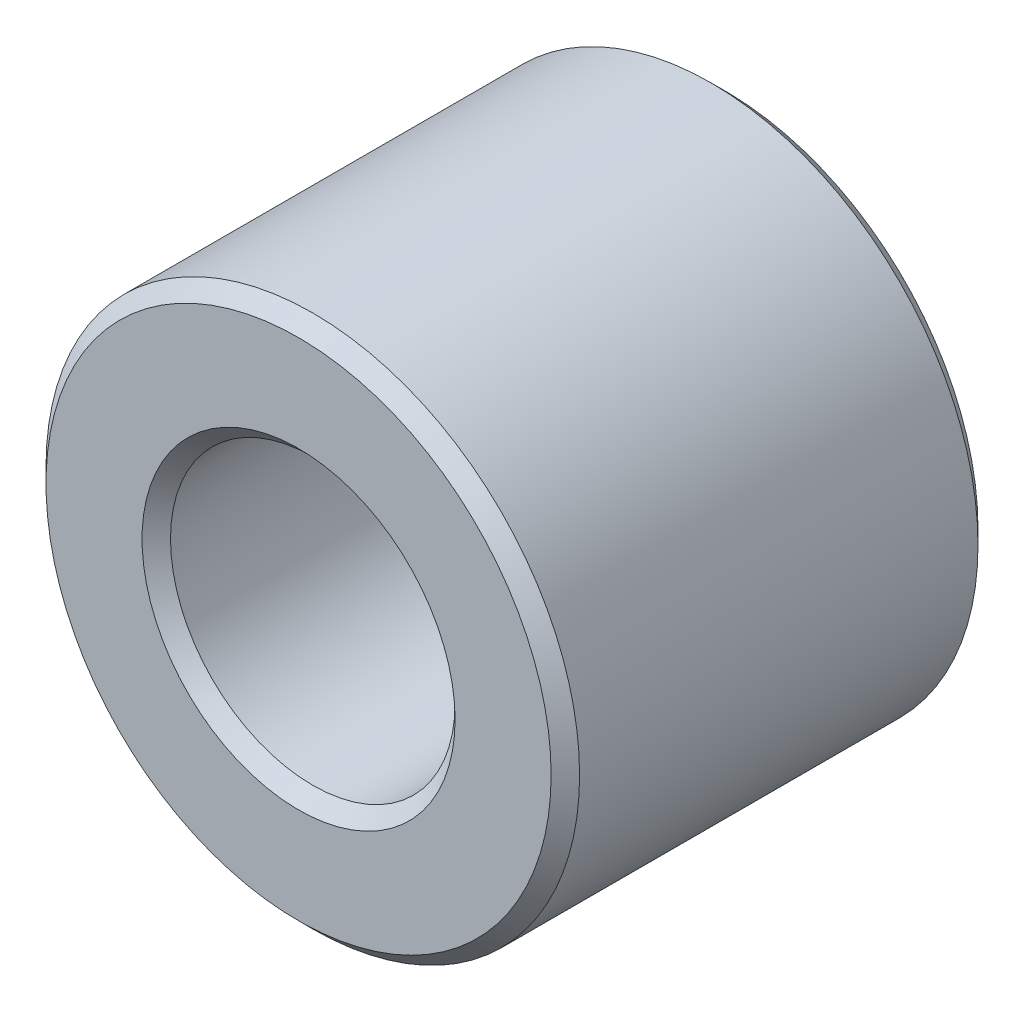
ISO-10303-21;
HEADER;
FILE_DESCRIPTION(('STEP AP214'),'2;1');
FILE_NAME('part.step','',(''),(''),'','','');
FILE_SCHEMA(('AUTOMOTIVE_DESIGN { 1 0 10303 214 1 1 1 1 }'));
ENDSEC;
DATA;
#1=APPLICATION_CONTEXT('core data for automotive mechanical design processes');
#2=APPLICATION_PROTOCOL_DEFINITION('international standard','automotive_design',2000,#1);
#3=PRODUCT_CONTEXT('',#1,'mechanical');
#4=PRODUCT('Part','Part','',(#3));
#5=PRODUCT_RELATED_PRODUCT_CATEGORY('part','',(#4));
#6=PRODUCT_DEFINITION_FORMATION('','',#4);
#7=PRODUCT_DEFINITION_CONTEXT('part definition',#1,'design');
#8=PRODUCT_DEFINITION('design','',#6,#7);
#9=PRODUCT_DEFINITION_SHAPE('','',#8);
#10=(LENGTH_UNIT() NAMED_UNIT(*) SI_UNIT(.MILLI.,.METRE.));
#11=(NAMED_UNIT(*) PLANE_ANGLE_UNIT() SI_UNIT($,.RADIAN.));
#12=(NAMED_UNIT(*) SI_UNIT($,.STERADIAN.) SOLID_ANGLE_UNIT());
#13=UNCERTAINTY_MEASURE_WITH_UNIT(LENGTH_MEASURE(1.E-05),#10,'distance_accuracy_value','');
#14=(GEOMETRIC_REPRESENTATION_CONTEXT(3) GLOBAL_UNCERTAINTY_ASSIGNED_CONTEXT((#13)) GLOBAL_UNIT_ASSIGNED_CONTEXT((#10,
#11,#12)) REPRESENTATION_CONTEXT('',''));
#15=CARTESIAN_POINT('',(0.,0.,0.));
#16=DIRECTION('',(0.,0.,1.));
#17=DIRECTION('',(1.,0.,0.));
#18=AXIS2_PLACEMENT_3D('',#15,#16,#17);
#19=CARTESIAN_POINT('',(0.,0.,24.));
#20=DIRECTION('',(0.,0.,1.));
#21=DIRECTION('',(1.,0.,0.));
#22=AXIS2_PLACEMENT_3D('',#19,#20,#21);
#23=PLANE('',#22);
#24=CARTESIAN_POINT('',(0.,0.,24.));
#25=DIRECTION('',(0.,0.,1.));
#26=DIRECTION('',(1.,0.,0.));
#27=AXIS2_PLACEMENT_3D('',#24,#25,#26);
#28=CIRCLE('',#27,17.6);
#29=CARTESIAN_POINT('',(17.6,0.,24.));
#30=VERTEX_POINT('',#29);
#31=EDGE_CURVE('E10',#30,#30,#28,.F.);
#32=ORIENTED_EDGE('',*,*,#31,.T.);
#33=EDGE_LOOP('',(#32));
#34=FACE_BOUND('',#33,.T.);
#35=CARTESIAN_POINT('',(0.,0.,24.));
#36=DIRECTION('',(0.,0.,1.));
#37=DIRECTION('',(1.,0.,0.));
#38=AXIS2_PLACEMENT_3D('',#35,#36,#37);
#39=CIRCLE('',#38,28.4);
#40=CARTESIAN_POINT('',(28.4,0.,24.));
#41=VERTEX_POINT('',#40);
#42=EDGE_CURVE('E45',#41,#41,#39,.T.);
#43=ORIENTED_EDGE('',*,*,#42,.T.);
#44=EDGE_LOOP('',(#43));
#45=FACE_BOUND('',#44,.T.);
#46=ADVANCED_FACE('F37',(#34,#45),#23,.T.);
#47=CARTESIAN_POINT('',(0.,0.,-24.));
#48=DIRECTION('',(0.,0.,1.));
#49=DIRECTION('',(1.,0.,0.));
#50=AXIS2_PLACEMENT_3D('',#47,#48,#49);
#51=PLANE('',#50);
#52=CARTESIAN_POINT('',(0.,0.,-24.));
#53=DIRECTION('',(0.,0.,1.));
#54=DIRECTION('',(1.,0.,0.));
#55=AXIS2_PLACEMENT_3D('',#52,#53,#54);
#56=CIRCLE('',#55,17.6);
#57=CARTESIAN_POINT('',(17.6,0.,-24.));
#58=VERTEX_POINT('',#57);
#59=EDGE_CURVE('E70',#58,#58,#56,.T.);
#60=ORIENTED_EDGE('',*,*,#59,.T.);
#61=EDGE_LOOP('',(#60));
#62=FACE_BOUND('',#61,.T.);
#63=CARTESIAN_POINT('',(0.,0.,-24.));
#64=DIRECTION('',(0.,0.,1.));
#65=DIRECTION('',(1.,0.,0.));
#66=AXIS2_PLACEMENT_3D('',#63,#64,#65);
#67=CIRCLE('',#66,28.4);
#68=CARTESIAN_POINT('',(28.4,0.,-24.));
#69=VERTEX_POINT('',#68);
#70=EDGE_CURVE('E74',#69,#69,#67,.F.);
#71=ORIENTED_EDGE('',*,*,#70,.T.);
#72=EDGE_LOOP('',(#71));
#73=FACE_BOUND('',#72,.T.);
#74=ADVANCED_FACE('F78',(#62,#73),#51,.F.);
#75=CARTESIAN_POINT('',(0.,0.,24.));
#76=DIRECTION('',(0.,0.,-1.));
#77=DIRECTION('',(-1.,0.,0.));
#78=AXIS2_PLACEMENT_3D('',#75,#76,#77);
#79=CYLINDRICAL_SURFACE('',#78,30.);
#80=CARTESIAN_POINT('',(0.,0.,-22.4));
#81=DIRECTION('',(0.,0.,1.));
#82=DIRECTION('',(1.,0.,0.));
#83=AXIS2_PLACEMENT_3D('',#80,#81,#82);
#84=CIRCLE('',#83,30.);
#85=CARTESIAN_POINT('',(30.,0.,-22.4));
#86=VERTEX_POINT('',#85);
#87=EDGE_CURVE('E52',#86,#86,#84,.T.);
#88=ORIENTED_EDGE('',*,*,#87,.T.);
#89=EDGE_LOOP('',(#88));
#90=FACE_BOUND('',#89,.T.);
#91=CARTESIAN_POINT('',(0.,0.,22.4));
#92=DIRECTION('',(0.,0.,1.));
#93=DIRECTION('',(1.,0.,0.));
#94=AXIS2_PLACEMENT_3D('',#91,#92,#93);
#95=CIRCLE('',#94,30.);
#96=CARTESIAN_POINT('',(30.,0.,22.4));
#97=VERTEX_POINT('',#96);
#98=EDGE_CURVE('E58',#97,#97,#95,.F.);
#99=ORIENTED_EDGE('',*,*,#98,.T.);
#100=EDGE_LOOP('',(#99));
#101=FACE_BOUND('',#100,.T.);
#102=ADVANCED_FACE('F88',(#90,#101),#79,.T.);
#103=CARTESIAN_POINT('',(0.,0.,24.));
#104=DIRECTION('',(0.,0.,-1.));
#105=DIRECTION('',(-1.,0.,0.));
#106=AXIS2_PLACEMENT_3D('',#103,#104,#105);
#107=CYLINDRICAL_SURFACE('',#106,16.);
#108=CARTESIAN_POINT('',(0.,0.,-22.4));
#109=DIRECTION('',(0.,0.,1.));
#110=DIRECTION('',(1.,0.,0.));
#111=AXIS2_PLACEMENT_3D('',#108,#109,#110);
#112=CIRCLE('',#111,16.);
#113=CARTESIAN_POINT('',(16.,0.,-22.4));
#114=VERTEX_POINT('',#113);
#115=EDGE_CURVE('E64',#114,#114,#112,.F.);
#116=ORIENTED_EDGE('',*,*,#115,.T.);
#117=EDGE_LOOP('',(#116));
#118=FACE_BOUND('',#117,.T.);
#119=CARTESIAN_POINT('',(0.,0.,22.4));
#120=DIRECTION('',(0.,0.,1.));
#121=DIRECTION('',(1.,0.,0.));
#122=AXIS2_PLACEMENT_3D('',#119,#120,#121);
#123=CIRCLE('',#122,16.);
#124=CARTESIAN_POINT('',(16.,0.,22.4));
#125=VERTEX_POINT('',#124);
#126=EDGE_CURVE('E67',#125,#125,#123,.T.);
#127=ORIENTED_EDGE('',*,*,#126,.T.);
#128=EDGE_LOOP('',(#127));
#129=FACE_BOUND('',#128,.T.);
#130=ADVANCED_FACE('F91',(#118,#129),#107,.F.);
#131=CARTESIAN_POINT('',(0.,0.,-24.));
#132=DIRECTION('',(0.,0.,-1.));
#133=DIRECTION('',(-1.,0.,0.));
#134=AXIS2_PLACEMENT_3D('',#131,#132,#133);
#135=CONICAL_SURFACE('',#134,17.6,0.785398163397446);
#136=ORIENTED_EDGE('',*,*,#115,.F.);
#137=EDGE_LOOP('',(#136));
#138=FACE_BOUND('',#137,.T.);
#139=ORIENTED_EDGE('',*,*,#59,.F.);
#140=EDGE_LOOP('',(#139));
#141=FACE_BOUND('',#140,.T.);
#142=ADVANCED_FACE('F84',(#138,#141),#135,.F.);
#143=CARTESIAN_POINT('',(0.,0.,-22.4));
#144=DIRECTION('',(0.,0.,1.));
#145=DIRECTION('',(1.,0.,0.));
#146=AXIS2_PLACEMENT_3D('',#143,#144,#145);
#147=CONICAL_SURFACE('',#146,30.,0.785398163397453);
#148=ORIENTED_EDGE('',*,*,#70,.F.);
#149=EDGE_LOOP('',(#148));
#150=FACE_BOUND('',#149,.T.);
#151=ORIENTED_EDGE('',*,*,#87,.F.);
#152=EDGE_LOOP('',(#151));
#153=FACE_BOUND('',#152,.T.);
#154=ADVANCED_FACE('F80',(#150,#153),#147,.T.);
#155=CARTESIAN_POINT('',(0.,0.,22.4));
#156=DIRECTION('',(0.,0.,1.));
#157=DIRECTION('',(1.,0.,0.));
#158=AXIS2_PLACEMENT_3D('',#155,#156,#157);
#159=CONICAL_SURFACE('',#158,16.,0.785398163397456);
#160=ORIENTED_EDGE('',*,*,#31,.F.);
#161=EDGE_LOOP('',(#160));
#162=FACE_BOUND('',#161,.T.);
#163=ORIENTED_EDGE('',*,*,#126,.F.);
#164=EDGE_LOOP('',(#163));
#165=FACE_BOUND('',#164,.T.);
#166=ADVANCED_FACE('F83',(#162,#165),#159,.F.);
#167=CARTESIAN_POINT('',(0.,0.,24.));
#168=DIRECTION('',(0.,0.,-1.));
#169=DIRECTION('',(-1.,0.,0.));
#170=AXIS2_PLACEMENT_3D('',#167,#168,#169);
#171=CONICAL_SURFACE('',#170,28.4,0.785398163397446);
#172=ORIENTED_EDGE('',*,*,#98,.F.);
#173=EDGE_LOOP('',(#172));
#174=FACE_BOUND('',#173,.T.);
#175=ORIENTED_EDGE('',*,*,#42,.F.);
#176=EDGE_LOOP('',(#175));
#177=FACE_BOUND('',#176,.T.);
#178=ADVANCED_FACE('F39',(#174,#177),#171,.T.);
#179=CLOSED_SHELL('',(#46,#74,#102,#130,#142,#154,#166,#178));
#180=MANIFOLD_SOLID_BREP('B2',#179);
#181=ADVANCED_BREP_SHAPE_REPRESENTATION('',(#18,#180),#14);
#182=SHAPE_DEFINITION_REPRESENTATION(#9,#181);
ENDSEC;
END-ISO-10303-21;
